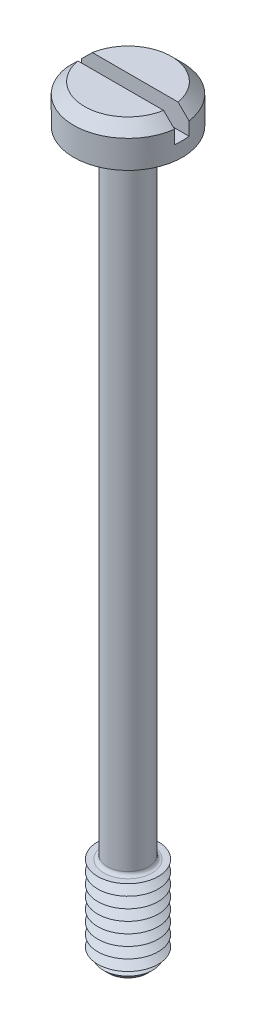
ISO-10303-21;
HEADER;
FILE_DESCRIPTION(('STEP AP214'),'2;1');
FILE_NAME('part.step','',(''),(''),'','','');
FILE_SCHEMA(('AUTOMOTIVE_DESIGN { 1 0 10303 214 1 1 1 1 }'));
ENDSEC;
DATA;
#1=APPLICATION_CONTEXT('core data for automotive mechanical design processes');
#2=APPLICATION_PROTOCOL_DEFINITION('international standard','automotive_design',2000,#1);
#3=PRODUCT_CONTEXT('',#1,'mechanical');
#4=PRODUCT('Part','Part','',(#3));
#5=PRODUCT_RELATED_PRODUCT_CATEGORY('part','',(#4));
#6=PRODUCT_DEFINITION_FORMATION('','',#4);
#7=PRODUCT_DEFINITION_CONTEXT('part definition',#1,'design');
#8=PRODUCT_DEFINITION('design','',#6,#7);
#9=PRODUCT_DEFINITION_SHAPE('','',#8);
#10=(LENGTH_UNIT() NAMED_UNIT(*) SI_UNIT(.MILLI.,.METRE.));
#11=(NAMED_UNIT(*) PLANE_ANGLE_UNIT() SI_UNIT($,.RADIAN.));
#12=(NAMED_UNIT(*) SI_UNIT($,.STERADIAN.) SOLID_ANGLE_UNIT());
#13=UNCERTAINTY_MEASURE_WITH_UNIT(LENGTH_MEASURE(1.E-05),#10,'distance_accuracy_value','');
#14=(GEOMETRIC_REPRESENTATION_CONTEXT(3) GLOBAL_UNCERTAINTY_ASSIGNED_CONTEXT((#13)) GLOBAL_UNIT_ASSIGNED_CONTEXT((#10,
#11,#12)) REPRESENTATION_CONTEXT('',''));
#15=CARTESIAN_POINT('',(0.,0.,0.));
#16=DIRECTION('',(0.,0.,1.));
#17=DIRECTION('',(1.,0.,0.));
#18=AXIS2_PLACEMENT_3D('',#15,#16,#17);
#19=CARTESIAN_POINT('',(0.,1.6,0.));
#20=DIRECTION('',(0.,1.,0.));
#21=DIRECTION('',(0.,0.,1.));
#22=AXIS2_PLACEMENT_3D('',#19,#20,#21);
#23=PLANE('',#22);
#24=DIRECTION('',(-1.,0.,0.));
#25=VECTOR('',#24,1.);
#26=CARTESIAN_POINT('',(2.25,1.6,-0.3));
#27=LINE('',#26,#25);
#28=CARTESIAN_POINT('',(1.77482393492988,1.6,-0.3));
#29=VERTEX_POINT('',#28);
#30=CARTESIAN_POINT('',(-1.77482393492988,1.6,-0.3));
#31=VERTEX_POINT('',#30);
#32=EDGE_CURVE('E110',#29,#31,#27,.T.);
#33=ORIENTED_EDGE('',*,*,#32,.F.);
#34=CARTESIAN_POINT('',(0.,1.6,0.));
#35=DIRECTION('',(0.,1.,0.));
#36=DIRECTION('',(0.,0.,1.));
#37=AXIS2_PLACEMENT_3D('',#34,#35,#36);
#38=CIRCLE('',#37,1.8);
#39=EDGE_CURVE('E113',#29,#31,#38,.T.);
#40=ORIENTED_EDGE('',*,*,#39,.T.);
#41=EDGE_LOOP('',(#33,#40));
#42=FACE_BOUND('',#41,.T.);
#43=ADVANCED_FACE('F39',(#42),#23,.T.);
#44=CARTESIAN_POINT('',(0.,1.6,0.));
#45=DIRECTION('',(0.,-1.,0.));
#46=DIRECTION('',(0.,0.,-1.));
#47=AXIS2_PLACEMENT_3D('',#44,#45,#46);
#48=CONICAL_SURFACE('',#47,1.8,0.785398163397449);
#49=CARTESIAN_POINT('',(4.95459224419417,-1.56366641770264,-0.3));
#50=CARTESIAN_POINT('',(4.78550585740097,-1.39489159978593,-0.3));
#51=CARTESIAN_POINT('',(4.61640599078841,-1.22613027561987,-0.3));
#52=CARTESIAN_POINT('',(4.27815962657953,-0.888649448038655,-0.3));
#53=CARTESIAN_POINT('',(4.10901312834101,-0.71992994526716,-0.3));
#54=CARTESIAN_POINT('',(3.7706037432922,-0.382497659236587,-0.3));
#55=CARTESIAN_POINT('',(3.60134083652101,-0.213784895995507,-0.3));
#56=CARTESIAN_POINT('',(3.26272497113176,0.123545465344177,-0.3));
#57=CARTESIAN_POINT('',(3.0933720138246,0.292163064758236,-0.3));
#58=CARTESIAN_POINT('',(2.74975444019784,0.633985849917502,-0.3));
#59=CARTESIAN_POINT('',(2.57548557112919,0.807186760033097,-0.3));
#60=CARTESIAN_POINT('',(2.22666801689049,1.15332162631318,-0.3));
#61=CARTESIAN_POINT('',(2.05211932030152,1.32625557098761,-0.3));
#62=CARTESIAN_POINT('',(1.78988225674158,1.58520097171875,-0.3));
#63=CARTESIAN_POINT('',(1.70241000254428,1.67143125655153,-0.3));
#64=CARTESIAN_POINT('',(1.52723599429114,1.84366185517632,-0.3));
#65=CARTESIAN_POINT('',(1.43953423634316,1.92966216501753,-0.3));
#66=CARTESIAN_POINT('',(1.26375483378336,2.10126365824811,-0.3));
#67=CARTESIAN_POINT('',(1.17567721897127,2.18686487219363,-0.3));
#68=CARTESIAN_POINT('',(0.998839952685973,2.35735922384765,-0.3));
#69=CARTESIAN_POINT('',(0.910080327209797,2.44225238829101,-0.3));
#70=CARTESIAN_POINT('',(0.796416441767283,2.54899153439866,-0.3));
#71=CARTESIAN_POINT('',(0.772225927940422,2.5715963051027,-0.3));
#72=CARTESIAN_POINT('',(0.72369279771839,2.61664290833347,-0.3));
#73=CARTESIAN_POINT('',(0.699350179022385,2.63908473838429,-0.3));
#74=CARTESIAN_POINT('',(0.650528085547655,2.68369783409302,-0.3));
#75=CARTESIAN_POINT('',(0.626049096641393,2.70586963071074,-0.3));
#76=CARTESIAN_POINT('',(0.576826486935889,2.74991696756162,-0.3));
#77=CARTESIAN_POINT('',(0.552082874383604,2.77179251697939,-0.3));
#78=CARTESIAN_POINT('',(0.495367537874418,2.82108684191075,-0.3));
#79=CARTESIAN_POINT('',(0.463281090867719,2.84837386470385,-0.3));
#80=CARTESIAN_POINT('',(0.398023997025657,2.90193742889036,-0.3));
#81=CARTESIAN_POINT('',(0.364849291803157,2.92820913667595,-0.3));
#82=CARTESIAN_POINT('',(0.313679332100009,2.96610502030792,-0.3));
#83=CARTESIAN_POINT('',(0.29629338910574,2.97854603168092,-0.3));
#84=CARTESIAN_POINT('',(0.260958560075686,3.00259516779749,-0.3));
#85=CARTESIAN_POINT('',(0.243009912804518,3.01420363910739,-0.3));
#86=CARTESIAN_POINT('',(0.206442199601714,3.03612496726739,-0.3));
#87=CARTESIAN_POINT('',(0.18782680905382,3.04644383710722,-0.3));
#88=CARTESIAN_POINT('',(0.149667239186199,3.06515059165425,-0.3));
#89=CARTESIAN_POINT('',(0.13012506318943,3.07354243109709,-0.3));
#90=CARTESIAN_POINT('',(0.0899770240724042,3.0873606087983,-0.3));
#91=CARTESIAN_POINT('',(0.0693720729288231,3.09278944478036,-0.3));
#92=CARTESIAN_POINT('',(0.0275643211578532,3.09943051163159,-0.3));
#93=CARTESIAN_POINT('',(0.00636584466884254,3.1006678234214,-0.3));
#94=CARTESIAN_POINT('',(-0.0358007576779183,3.09861060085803,-0.3));
#95=CARTESIAN_POINT('',(-0.0567687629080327,3.09531379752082,-0.3));
#96=CARTESIAN_POINT('',(-0.0978737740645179,3.08507807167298,-0.3));
#97=CARTESIAN_POINT('',(-0.118004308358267,3.07811501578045,-0.3));
#98=CARTESIAN_POINT('',(-0.162483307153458,3.05957916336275,-0.3));
#99=CARTESIAN_POINT('',(-0.186511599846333,3.04727044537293,-0.3));
#100=CARTESIAN_POINT('',(-0.233318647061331,3.02043354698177,-0.3));
#101=CARTESIAN_POINT('',(-0.256093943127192,3.00589960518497,-0.3));
#102=CARTESIAN_POINT('',(-0.300901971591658,2.97541580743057,-0.3));
#103=CARTESIAN_POINT('',(-0.322928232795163,2.95945657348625,-0.3));
#104=CARTESIAN_POINT('',(-0.366316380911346,2.92672827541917,-0.3));
#105=CARTESIAN_POINT('',(-0.387679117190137,2.90996032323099,-0.3));
#106=CARTESIAN_POINT('',(-0.433394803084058,2.8731039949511,-0.3));
#107=CARTESIAN_POINT('',(-0.457669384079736,2.85291891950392,-0.3));
#108=CARTESIAN_POINT('',(-0.505802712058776,2.812057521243,-0.3));
#109=CARTESIAN_POINT('',(-0.529661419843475,2.79138115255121,-0.3));
#110=CARTESIAN_POINT('',(-0.600811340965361,2.72884009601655,-0.3));
#111=CARTESIAN_POINT('',(-0.647661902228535,2.6864754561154,-0.3));
#112=CARTESIAN_POINT('',(-0.740776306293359,2.60099002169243,-0.3));
#113=CARTESIAN_POINT('',(-0.787039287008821,2.55786829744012,-0.3));
#114=CARTESIAN_POINT('',(-0.879151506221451,2.47120207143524,-0.3));
#115=CARTESIAN_POINT('',(-0.925000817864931,2.42765764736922,-0.3));
#116=CARTESIAN_POINT('',(-1.06157343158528,2.29718252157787,-0.3));
#117=CARTESIAN_POINT('',(-1.15191647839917,2.20985470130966,-0.3));
#118=CARTESIAN_POINT('',(-1.33204374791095,2.0347474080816,-0.3));
#119=CARTESIAN_POINT('',(-1.42182830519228,1.94696827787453,-0.3));
#120=CARTESIAN_POINT('',(-1.65511823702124,1.71815111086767,-0.3));
#121=CARTESIAN_POINT('',(-1.79840096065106,1.57688614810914,-0.3));
#122=CARTESIAN_POINT('',(-2.08462326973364,1.2940074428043,-0.3));
#123=CARTESIAN_POINT('',(-2.22756285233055,1.15239369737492,-0.3));
#124=CARTESIAN_POINT('',(-2.65618391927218,0.727177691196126,-0.3));
#125=CARTESIAN_POINT('',(-2.94157972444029,0.443287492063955,-0.3));
#126=CARTESIAN_POINT('',(-3.51504981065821,-0.12773549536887,-0.3));
#127=CARTESIAN_POINT('',(-3.80312108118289,-0.414871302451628,-0.3));
#128=CARTESIAN_POINT('',(-4.3789998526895,-0.989219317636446,-0.3));
#129=CARTESIAN_POINT('',(-4.66680740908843,-1.27643147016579,-0.3));
#130=CARTESIAN_POINT('',(-4.95459224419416,-1.56366641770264,-0.3));
#131=B_SPLINE_CURVE_WITH_KNOTS('',3,(#49,#50,#51,#52,#53,#54,#55,#56,#57,#58,#59,#60,#61,#62,
#63,#64,#65,#66,#67,#68,#69,#70,#71,#72,#73,#74,#75,#76,#77,#78,#79,#80,#81,#82,#83,#84,#85,#86,
#87,#88,#89,#90,#91,#92,#93,#94,#95,#96,#97,#98,#99,#100,#101,#102,#103,#104,#105,#106,#107,
#108,#109,#110,#111,#112,#113,#114,#115,#116,#117,#118,#119,#120,#121,#122,#123,#124,#125,#126,
#127,#128,#129,#130),.UNSPECIFIED.,.F.,.F.,(4,2,2,2,2,2,2,2,2,2,2,2,2,2,2,2,2,2,2,2,2,2,2,2,2,2,
2,2,2,2,2,2,2,2,2,2,2,2,2,2,4),(0.,0.716712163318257,1.4334347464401,2.1503903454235,
2.86733577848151,3.60443392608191,4.34156295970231,4.71005096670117,5.07854526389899,
5.44701086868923,5.81546249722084,5.91478669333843,6.01411239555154,6.1131930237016,
6.21227057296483,6.33862193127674,6.46551497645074,6.52963544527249,6.59372906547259,
6.65751170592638,6.7211622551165,6.78475906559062,6.8479746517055,6.91122188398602,
6.97489074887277,7.05566851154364,7.13665907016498,7.21822852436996,7.29968885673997,
7.39438996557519,7.48909995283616,7.67857624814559,7.86830424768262,8.05799801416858,
8.43494407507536,8.81163695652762,9.41526715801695,10.0189023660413,11.2265436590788,
12.4467437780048,13.6665454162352),.UNSPECIFIED.);
#132=CARTESIAN_POINT('',(2.2299103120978,1.14999999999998,-0.3));
#133=VERTEX_POINT('',#132);
#134=EDGE_CURVE('E260',#133,#29,#131,.T.);
#135=ORIENTED_EDGE('',*,*,#134,.F.);
#136=CARTESIAN_POINT('',(0.,1.15,0.));
#137=DIRECTION('',(0.,1.,0.));
#138=DIRECTION('',(0.,0.,1.));
#139=AXIS2_PLACEMENT_3D('',#136,#137,#138);
#140=CIRCLE('',#139,2.25);
#141=CARTESIAN_POINT('',(-2.22991031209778,1.15,-0.3));
#142=VERTEX_POINT('',#141);
#143=EDGE_CURVE('E128',#142,#133,#140,.F.);
#144=ORIENTED_EDGE('',*,*,#143,.F.);
#145=EDGE_CURVE('E102',#31,#142,#131,.T.);
#146=ORIENTED_EDGE('',*,*,#145,.F.);
#147=ORIENTED_EDGE('',*,*,#39,.F.);
#148=EDGE_LOOP('',(#135,#144,#146,#147));
#149=FACE_BOUND('',#148,.T.);
#150=ADVANCED_FACE('F222',(#149),#48,.T.);
#151=CARTESIAN_POINT('',(0.,-30.,0.));
#152=DIRECTION('',(0.,1.,0.));
#153=DIRECTION('',(0.,0.,1.));
#154=AXIS2_PLACEMENT_3D('',#151,#152,#153);
#155=CYLINDRICAL_SURFACE('',#154,0.85);
#156=CARTESIAN_POINT('',(0.,-26.15,0.));
#157=DIRECTION('',(0.,-1.,0.));
#158=DIRECTION('',(0.,0.,-1.));
#159=AXIS2_PLACEMENT_3D('',#156,#157,#158);
#160=CIRCLE('',#159,0.85);
#161=CARTESIAN_POINT('',(0.,-26.15,-0.85));
#162=VERTEX_POINT('',#161);
#163=EDGE_CURVE('E123',#162,#162,#160,.F.);
#164=ORIENTED_EDGE('',*,*,#163,.T.);
#165=EDGE_LOOP('',(#164));
#166=FACE_BOUND('',#165,.T.);
#167=CARTESIAN_POINT('',(0.,-0.150000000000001,0.));
#168=DIRECTION('',(0.,1.,0.));
#169=DIRECTION('',(0.,0.,1.));
#170=AXIS2_PLACEMENT_3D('',#167,#168,#169);
#171=CIRCLE('',#170,0.85);
#172=CARTESIAN_POINT('',(0.,-0.150000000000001,0.85));
#173=VERTEX_POINT('',#172);
#174=EDGE_CURVE('E365',#173,#173,#171,.F.);
#175=ORIENTED_EDGE('',*,*,#174,.T.);
#176=EDGE_LOOP('',(#175));
#177=FACE_BOUND('',#176,.T.);
#178=ADVANCED_FACE('F218',(#166,#177),#155,.T.);
#179=CARTESIAN_POINT('',(0.,1.6,0.));
#180=DIRECTION('',(0.,-1.,0.));
#181=DIRECTION('',(0.,0.,-1.));
#182=AXIS2_PLACEMENT_3D('',#179,#180,#181);
#183=CYLINDRICAL_SURFACE('',#182,2.25);
#184=ORIENTED_EDGE('',*,*,#143,.T.);
#185=DIRECTION('',(0.,-1.,0.));
#186=VECTOR('',#185,1.);
#187=CARTESIAN_POINT('',(2.22991031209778,1.6,-0.3));
#188=LINE('',#187,#186);
#189=CARTESIAN_POINT('',(2.22991031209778,0.6,-0.3));
#190=VERTEX_POINT('',#189);
#191=EDGE_CURVE('E64',#133,#190,#188,.T.);
#192=ORIENTED_EDGE('',*,*,#191,.T.);
#193=CARTESIAN_POINT('',(0.,0.6,0.));
#194=DIRECTION('',(0.,1.,0.));
#195=DIRECTION('',(0.,0.,1.));
#196=AXIS2_PLACEMENT_3D('',#193,#194,#195);
#197=CIRCLE('',#196,2.25);
#198=CARTESIAN_POINT('',(2.22991031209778,0.6,0.3));
#199=VERTEX_POINT('',#198);
#200=EDGE_CURVE('E11',#199,#190,#197,.T.);
#201=ORIENTED_EDGE('',*,*,#200,.F.);
#202=DIRECTION('',(0.,-1.,0.));
#203=VECTOR('',#202,1.);
#204=CARTESIAN_POINT('',(2.22991031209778,1.6,0.3));
#205=LINE('',#204,#203);
#206=CARTESIAN_POINT('',(2.22991031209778,1.15,0.3));
#207=VERTEX_POINT('',#206);
#208=EDGE_CURVE('E275',#199,#207,#205,.F.);
#209=ORIENTED_EDGE('',*,*,#208,.T.);
#210=CARTESIAN_POINT('',(-2.2299103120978,1.14999999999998,0.3));
#211=VERTEX_POINT('',#210);
#212=EDGE_CURVE('E120',#207,#211,#140,.F.);
#213=ORIENTED_EDGE('',*,*,#212,.T.);
#214=DIRECTION('',(0.,-1.,0.));
#215=VECTOR('',#214,1.);
#216=CARTESIAN_POINT('',(-2.22991031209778,1.6,0.3));
#217=LINE('',#216,#215);
#218=CARTESIAN_POINT('',(-2.22991031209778,0.6,0.3));
#219=VERTEX_POINT('',#218);
#220=EDGE_CURVE('E96',#211,#219,#217,.T.);
#221=ORIENTED_EDGE('',*,*,#220,.T.);
#222=CARTESIAN_POINT('',(-2.22991031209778,0.6,-0.3));
#223=VERTEX_POINT('',#222);
#224=EDGE_CURVE('E44',#223,#219,#197,.T.);
#225=ORIENTED_EDGE('',*,*,#224,.F.);
#226=DIRECTION('',(0.,-1.,0.));
#227=VECTOR('',#226,1.);
#228=CARTESIAN_POINT('',(-2.22991031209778,1.6,-0.3));
#229=LINE('',#228,#227);
#230=EDGE_CURVE('E280',#223,#142,#229,.F.);
#231=ORIENTED_EDGE('',*,*,#230,.T.);
#232=EDGE_LOOP('',(#184,#192,#201,#209,#213,#221,#225,#231));
#233=FACE_BOUND('',#232,.T.);
#234=CARTESIAN_POINT('',(0.,0.,0.));
#235=DIRECTION('',(0.,1.,0.));
#236=DIRECTION('',(0.,0.,1.));
#237=AXIS2_PLACEMENT_3D('',#234,#235,#236);
#238=CIRCLE('',#237,2.25);
#239=CARTESIAN_POINT('',(0.,0.,2.25));
#240=VERTEX_POINT('',#239);
#241=EDGE_CURVE('E351',#240,#240,#238,.T.);
#242=ORIENTED_EDGE('',*,*,#241,.T.);
#243=EDGE_LOOP('',(#242));
#244=FACE_BOUND('',#243,.T.);
#245=ADVANCED_FACE('F221',(#233,#244),#183,.T.);
#246=DIRECTION('',(1.,0.,0.));
#247=VECTOR('',#246,1.);
#248=CARTESIAN_POINT('',(2.25,1.6,0.3));
#249=LINE('',#248,#247);
#250=CARTESIAN_POINT('',(-1.77482393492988,1.6,0.3));
#251=VERTEX_POINT('',#250);
#252=CARTESIAN_POINT('',(1.77482393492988,1.6,0.3));
#253=VERTEX_POINT('',#252);
#254=EDGE_CURVE('E56',#251,#253,#249,.T.);
#255=ORIENTED_EDGE('',*,*,#254,.F.);
#256=EDGE_CURVE('E108',#251,#253,#38,.T.);
#257=ORIENTED_EDGE('',*,*,#256,.T.);
#258=EDGE_LOOP('',(#255,#257));
#259=FACE_BOUND('',#258,.T.);
#260=ADVANCED_FACE('F107',(#259),#23,.T.);
#261=CARTESIAN_POINT('',(0.,0.,0.));
#262=DIRECTION('',(0.,1.,0.));
#263=DIRECTION('',(0.,0.,1.));
#264=AXIS2_PLACEMENT_3D('',#261,#262,#263);
#265=PLANE('',#264);
#266=CARTESIAN_POINT('',(0.,0.,0.));
#267=DIRECTION('',(0.,1.,0.));
#268=DIRECTION('',(0.,0.,1.));
#269=AXIS2_PLACEMENT_3D('',#266,#267,#268);
#270=CIRCLE('',#269,1.);
#271=CARTESIAN_POINT('',(0.,0.,1.));
#272=VERTEX_POINT('',#271);
#273=EDGE_CURVE('E114',#272,#272,#270,.T.);
#274=ORIENTED_EDGE('',*,*,#273,.T.);
#275=EDGE_LOOP('',(#274));
#276=FACE_BOUND('',#275,.T.);
#277=ORIENTED_EDGE('',*,*,#241,.F.);
#278=EDGE_LOOP('',(#277));
#279=FACE_BOUND('',#278,.T.);
#280=ADVANCED_FACE('F212',(#276,#279),#265,.F.);
#281=CARTESIAN_POINT('',(0.,-26.3,0.));
#282=DIRECTION('',(0.,-1.,0.));
#283=DIRECTION('',(0.,0.,-1.));
#284=AXIS2_PLACEMENT_3D('',#281,#282,#283);
#285=PLANE('',#284);
#286=CARTESIAN_POINT('',(0.,-26.3,0.));
#287=DIRECTION('',(0.,-1.,0.));
#288=DIRECTION('',(0.,0.,-1.));
#289=AXIS2_PLACEMENT_3D('',#286,#287,#288);
#290=CIRCLE('',#289,1.);
#291=CARTESIAN_POINT('',(0.,-26.3,-1.));
#292=VERTEX_POINT('',#291);
#293=EDGE_CURVE('E358',#292,#292,#290,.T.);
#294=ORIENTED_EDGE('',*,*,#293,.T.);
#295=EDGE_LOOP('',(#294));
#296=FACE_BOUND('',#295,.T.);
#297=CARTESIAN_POINT('',(0.,-26.3,0.));
#298=DIRECTION('',(0.,1.,0.));
#299=DIRECTION('',(0.,0.,1.));
#300=AXIS2_PLACEMENT_3D('',#297,#298,#299);
#301=CIRCLE('',#300,1.25);
#302=CARTESIAN_POINT('',(0.,-26.3,1.25));
#303=VERTEX_POINT('',#302);
#304=EDGE_CURVE('E348',#303,#303,#301,.T.);
#305=ORIENTED_EDGE('',*,*,#304,.T.);
#306=EDGE_LOOP('',(#305));
#307=FACE_BOUND('',#306,.T.);
#308=ADVANCED_FACE('F208',(#296,#307),#285,.F.);
#309=CARTESIAN_POINT('',(0.,-26.525,0.));
#310=DIRECTION('',(0.,1.,0.));
#311=DIRECTION('',(0.,0.,1.));
#312=AXIS2_PLACEMENT_3D('',#309,#310,#311);
#313=CONICAL_SURFACE('',#312,0.860288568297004,1.0471975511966);
#314=ORIENTED_EDGE('',*,*,#304,.F.);
#315=EDGE_LOOP('',(#314));
#316=FACE_BOUND('',#315,.T.);
#317=CARTESIAN_POINT('',(0.,-26.525,0.));
#318=DIRECTION('',(0.,1.,0.));
#319=DIRECTION('',(0.,0.,1.));
#320=AXIS2_PLACEMENT_3D('',#317,#318,#319);
#321=CIRCLE('',#320,0.860288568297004);
#322=CARTESIAN_POINT('',(0.,-26.525,0.860288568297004));
#323=VERTEX_POINT('',#322);
#324=EDGE_CURVE('E344',#323,#323,#321,.T.);
#325=ORIENTED_EDGE('',*,*,#324,.T.);
#326=EDGE_LOOP('',(#325));
#327=FACE_BOUND('',#326,.T.);
#328=ADVANCED_FACE('F204',(#316,#327),#313,.T.);
#329=CARTESIAN_POINT('',(0.,-26.75,0.));
#330=DIRECTION('',(0.,-1.,0.));
#331=DIRECTION('',(0.,0.,-1.));
#332=AXIS2_PLACEMENT_3D('',#329,#330,#331);
#333=CONICAL_SURFACE('',#332,1.25,1.0471975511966);
#334=ORIENTED_EDGE('',*,*,#324,.F.);
#335=EDGE_LOOP('',(#334));
#336=FACE_BOUND('',#335,.T.);
#337=CARTESIAN_POINT('',(0.,-26.75,0.));
#338=DIRECTION('',(0.,1.,0.));
#339=DIRECTION('',(0.,0.,1.));
#340=AXIS2_PLACEMENT_3D('',#337,#338,#339);
#341=CIRCLE('',#340,1.25);
#342=CARTESIAN_POINT('',(0.,-26.75,1.25));
#343=VERTEX_POINT('',#342);
#344=EDGE_CURVE('E340',#343,#343,#341,.T.);
#345=ORIENTED_EDGE('',*,*,#344,.T.);
#346=EDGE_LOOP('',(#345));
#347=FACE_BOUND('',#346,.T.);
#348=ADVANCED_FACE('F200',(#336,#347),#333,.T.);
#349=CARTESIAN_POINT('',(0.,-26.975,0.));
#350=DIRECTION('',(0.,1.,0.));
#351=DIRECTION('',(0.,0.,1.));
#352=AXIS2_PLACEMENT_3D('',#349,#350,#351);
#353=CONICAL_SURFACE('',#352,0.860288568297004,1.0471975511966);
#354=ORIENTED_EDGE('',*,*,#344,.F.);
#355=EDGE_LOOP('',(#354));
#356=FACE_BOUND('',#355,.T.);
#357=CARTESIAN_POINT('',(0.,-26.975,0.));
#358=DIRECTION('',(0.,1.,0.));
#359=DIRECTION('',(0.,0.,1.));
#360=AXIS2_PLACEMENT_3D('',#357,#358,#359);
#361=CIRCLE('',#360,0.860288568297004);
#362=CARTESIAN_POINT('',(0.,-26.975,0.860288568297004));
#363=VERTEX_POINT('',#362);
#364=EDGE_CURVE('E336',#363,#363,#361,.T.);
#365=ORIENTED_EDGE('',*,*,#364,.T.);
#366=EDGE_LOOP('',(#365));
#367=FACE_BOUND('',#366,.T.);
#368=ADVANCED_FACE('F196',(#356,#367),#353,.T.);
#369=CARTESIAN_POINT('',(0.,-27.2,0.));
#370=DIRECTION('',(0.,-1.,0.));
#371=DIRECTION('',(0.,0.,-1.));
#372=AXIS2_PLACEMENT_3D('',#369,#370,#371);
#373=CONICAL_SURFACE('',#372,1.25,1.0471975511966);
#374=ORIENTED_EDGE('',*,*,#364,.F.);
#375=EDGE_LOOP('',(#374));
#376=FACE_BOUND('',#375,.T.);
#377=CARTESIAN_POINT('',(0.,-27.2,0.));
#378=DIRECTION('',(0.,1.,0.));
#379=DIRECTION('',(0.,0.,1.));
#380=AXIS2_PLACEMENT_3D('',#377,#378,#379);
#381=CIRCLE('',#380,1.25);
#382=CARTESIAN_POINT('',(0.,-27.2,1.25));
#383=VERTEX_POINT('',#382);
#384=EDGE_CURVE('E332',#383,#383,#381,.T.);
#385=ORIENTED_EDGE('',*,*,#384,.T.);
#386=EDGE_LOOP('',(#385));
#387=FACE_BOUND('',#386,.T.);
#388=ADVANCED_FACE('F192',(#376,#387),#373,.T.);
#389=CARTESIAN_POINT('',(0.,-27.425,0.));
#390=DIRECTION('',(0.,1.,0.));
#391=DIRECTION('',(0.,0.,1.));
#392=AXIS2_PLACEMENT_3D('',#389,#390,#391);
#393=CONICAL_SURFACE('',#392,0.860288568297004,1.0471975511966);
#394=ORIENTED_EDGE('',*,*,#384,.F.);
#395=EDGE_LOOP('',(#394));
#396=FACE_BOUND('',#395,.T.);
#397=CARTESIAN_POINT('',(0.,-27.425,0.));
#398=DIRECTION('',(0.,1.,0.));
#399=DIRECTION('',(0.,0.,1.));
#400=AXIS2_PLACEMENT_3D('',#397,#398,#399);
#401=CIRCLE('',#400,0.860288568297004);
#402=CARTESIAN_POINT('',(0.,-27.425,0.860288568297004));
#403=VERTEX_POINT('',#402);
#404=EDGE_CURVE('E328',#403,#403,#401,.T.);
#405=ORIENTED_EDGE('',*,*,#404,.T.);
#406=EDGE_LOOP('',(#405));
#407=FACE_BOUND('',#406,.T.);
#408=ADVANCED_FACE('F188',(#396,#407),#393,.T.);
#409=CARTESIAN_POINT('',(0.,-27.65,0.));
#410=DIRECTION('',(0.,-1.,0.));
#411=DIRECTION('',(0.,0.,-1.));
#412=AXIS2_PLACEMENT_3D('',#409,#410,#411);
#413=CONICAL_SURFACE('',#412,1.25,1.0471975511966);
#414=ORIENTED_EDGE('',*,*,#404,.F.);
#415=EDGE_LOOP('',(#414));
#416=FACE_BOUND('',#415,.T.);
#417=CARTESIAN_POINT('',(0.,-27.65,0.));
#418=DIRECTION('',(0.,1.,0.));
#419=DIRECTION('',(0.,0.,1.));
#420=AXIS2_PLACEMENT_3D('',#417,#418,#419);
#421=CIRCLE('',#420,1.25);
#422=CARTESIAN_POINT('',(0.,-27.65,1.25));
#423=VERTEX_POINT('',#422);
#424=EDGE_CURVE('E324',#423,#423,#421,.T.);
#425=ORIENTED_EDGE('',*,*,#424,.T.);
#426=EDGE_LOOP('',(#425));
#427=FACE_BOUND('',#426,.T.);
#428=ADVANCED_FACE('F184',(#416,#427),#413,.T.);
#429=CARTESIAN_POINT('',(0.,-27.875,0.));
#430=DIRECTION('',(0.,1.,0.));
#431=DIRECTION('',(0.,0.,1.));
#432=AXIS2_PLACEMENT_3D('',#429,#430,#431);
#433=CONICAL_SURFACE('',#432,0.860288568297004,1.0471975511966);
#434=ORIENTED_EDGE('',*,*,#424,.F.);
#435=EDGE_LOOP('',(#434));
#436=FACE_BOUND('',#435,.T.);
#437=CARTESIAN_POINT('',(0.,-27.875,0.));
#438=DIRECTION('',(0.,1.,0.));
#439=DIRECTION('',(0.,0.,1.));
#440=AXIS2_PLACEMENT_3D('',#437,#438,#439);
#441=CIRCLE('',#440,0.860288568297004);
#442=CARTESIAN_POINT('',(0.,-27.875,0.860288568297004));
#443=VERTEX_POINT('',#442);
#444=EDGE_CURVE('E320',#443,#443,#441,.T.);
#445=ORIENTED_EDGE('',*,*,#444,.T.);
#446=EDGE_LOOP('',(#445));
#447=FACE_BOUND('',#446,.T.);
#448=ADVANCED_FACE('F180',(#436,#447),#433,.T.);
#449=CARTESIAN_POINT('',(0.,-28.1,0.));
#450=DIRECTION('',(0.,-1.,0.));
#451=DIRECTION('',(0.,0.,-1.));
#452=AXIS2_PLACEMENT_3D('',#449,#450,#451);
#453=CONICAL_SURFACE('',#452,1.25,1.0471975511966);
#454=ORIENTED_EDGE('',*,*,#444,.F.);
#455=EDGE_LOOP('',(#454));
#456=FACE_BOUND('',#455,.T.);
#457=CARTESIAN_POINT('',(0.,-28.1,0.));
#458=DIRECTION('',(0.,1.,0.));
#459=DIRECTION('',(0.,0.,1.));
#460=AXIS2_PLACEMENT_3D('',#457,#458,#459);
#461=CIRCLE('',#460,1.25);
#462=CARTESIAN_POINT('',(0.,-28.1,1.25));
#463=VERTEX_POINT('',#462);
#464=EDGE_CURVE('E317',#463,#463,#461,.T.);
#465=ORIENTED_EDGE('',*,*,#464,.T.);
#466=EDGE_LOOP('',(#465));
#467=FACE_BOUND('',#466,.T.);
#468=ADVANCED_FACE('F176',(#456,#467),#453,.T.);
#469=CARTESIAN_POINT('',(0.,-28.325,0.));
#470=DIRECTION('',(0.,1.,0.));
#471=DIRECTION('',(0.,0.,1.));
#472=AXIS2_PLACEMENT_3D('',#469,#470,#471);
#473=CONICAL_SURFACE('',#472,0.860288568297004,1.0471975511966);
#474=ORIENTED_EDGE('',*,*,#464,.F.);
#475=EDGE_LOOP('',(#474));
#476=FACE_BOUND('',#475,.T.);
#477=CARTESIAN_POINT('',(0.,-28.325,0.));
#478=DIRECTION('',(0.,1.,0.));
#479=DIRECTION('',(0.,0.,1.));
#480=AXIS2_PLACEMENT_3D('',#477,#478,#479);
#481=CIRCLE('',#480,0.860288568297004);
#482=CARTESIAN_POINT('',(0.,-28.325,0.860288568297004));
#483=VERTEX_POINT('',#482);
#484=EDGE_CURVE('E313',#483,#483,#481,.T.);
#485=ORIENTED_EDGE('',*,*,#484,.T.);
#486=EDGE_LOOP('',(#485));
#487=FACE_BOUND('',#486,.T.);
#488=ADVANCED_FACE('F172',(#476,#487),#473,.T.);
#489=CARTESIAN_POINT('',(0.,-28.55,0.));
#490=DIRECTION('',(0.,-1.,0.));
#491=DIRECTION('',(0.,0.,-1.));
#492=AXIS2_PLACEMENT_3D('',#489,#490,#491);
#493=CONICAL_SURFACE('',#492,1.25,1.0471975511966);
#494=ORIENTED_EDGE('',*,*,#484,.F.);
#495=EDGE_LOOP('',(#494));
#496=FACE_BOUND('',#495,.T.);
#497=CARTESIAN_POINT('',(0.,-28.55,0.));
#498=DIRECTION('',(0.,1.,0.));
#499=DIRECTION('',(0.,0.,1.));
#500=AXIS2_PLACEMENT_3D('',#497,#498,#499);
#501=CIRCLE('',#500,1.25);
#502=CARTESIAN_POINT('',(0.,-28.55,1.25));
#503=VERTEX_POINT('',#502);
#504=EDGE_CURVE('E309',#503,#503,#501,.T.);
#505=ORIENTED_EDGE('',*,*,#504,.T.);
#506=EDGE_LOOP('',(#505));
#507=FACE_BOUND('',#506,.T.);
#508=ADVANCED_FACE('F168',(#496,#507),#493,.T.);
#509=CARTESIAN_POINT('',(0.,-28.775,0.));
#510=DIRECTION('',(0.,1.,0.));
#511=DIRECTION('',(0.,0.,1.));
#512=AXIS2_PLACEMENT_3D('',#509,#510,#511);
#513=CONICAL_SURFACE('',#512,0.860288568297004,1.0471975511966);
#514=ORIENTED_EDGE('',*,*,#504,.F.);
#515=EDGE_LOOP('',(#514));
#516=FACE_BOUND('',#515,.T.);
#517=CARTESIAN_POINT('',(0.,-28.775,0.));
#518=DIRECTION('',(0.,1.,0.));
#519=DIRECTION('',(0.,0.,1.));
#520=AXIS2_PLACEMENT_3D('',#517,#518,#519);
#521=CIRCLE('',#520,0.860288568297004);
#522=CARTESIAN_POINT('',(0.,-28.775,0.860288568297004));
#523=VERTEX_POINT('',#522);
#524=EDGE_CURVE('E306',#523,#523,#521,.T.);
#525=ORIENTED_EDGE('',*,*,#524,.T.);
#526=EDGE_LOOP('',(#525));
#527=FACE_BOUND('',#526,.T.);
#528=ADVANCED_FACE('F164',(#516,#527),#513,.T.);
#529=CARTESIAN_POINT('',(0.,-29.,0.));
#530=DIRECTION('',(0.,-1.,0.));
#531=DIRECTION('',(0.,0.,-1.));
#532=AXIS2_PLACEMENT_3D('',#529,#530,#531);
#533=CONICAL_SURFACE('',#532,1.25,1.0471975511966);
#534=ORIENTED_EDGE('',*,*,#524,.F.);
#535=EDGE_LOOP('',(#534));
#536=FACE_BOUND('',#535,.T.);
#537=CARTESIAN_POINT('',(0.,-29.,0.));
#538=DIRECTION('',(0.,1.,0.));
#539=DIRECTION('',(0.,0.,1.));
#540=AXIS2_PLACEMENT_3D('',#537,#538,#539);
#541=CIRCLE('',#540,1.25);
#542=CARTESIAN_POINT('',(0.,-29.,1.25));
#543=VERTEX_POINT('',#542);
#544=EDGE_CURVE('E303',#543,#543,#541,.T.);
#545=ORIENTED_EDGE('',*,*,#544,.T.);
#546=EDGE_LOOP('',(#545));
#547=FACE_BOUND('',#546,.T.);
#548=ADVANCED_FACE('F160',(#536,#547),#533,.T.);
#549=CARTESIAN_POINT('',(0.,-29.225,0.));
#550=DIRECTION('',(0.,1.,0.));
#551=DIRECTION('',(0.,0.,1.));
#552=AXIS2_PLACEMENT_3D('',#549,#550,#551);
#553=CONICAL_SURFACE('',#552,0.860288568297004,1.0471975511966);
#554=ORIENTED_EDGE('',*,*,#544,.F.);
#555=EDGE_LOOP('',(#554));
#556=FACE_BOUND('',#555,.T.);
#557=CARTESIAN_POINT('',(0.,-29.225,0.));
#558=DIRECTION('',(0.,1.,0.));
#559=DIRECTION('',(0.,0.,1.));
#560=AXIS2_PLACEMENT_3D('',#557,#558,#559);
#561=CIRCLE('',#560,0.860288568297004);
#562=CARTESIAN_POINT('',(0.,-29.225,0.860288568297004));
#563=VERTEX_POINT('',#562);
#564=EDGE_CURVE('E299',#563,#563,#561,.T.);
#565=ORIENTED_EDGE('',*,*,#564,.T.);
#566=EDGE_LOOP('',(#565));
#567=FACE_BOUND('',#566,.T.);
#568=ADVANCED_FACE('F156',(#556,#567),#553,.T.);
#569=CARTESIAN_POINT('',(0.,-29.45,0.));
#570=DIRECTION('',(0.,-1.,0.));
#571=DIRECTION('',(0.,0.,-1.));
#572=AXIS2_PLACEMENT_3D('',#569,#570,#571);
#573=CONICAL_SURFACE('',#572,1.25,1.0471975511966);
#574=ORIENTED_EDGE('',*,*,#564,.F.);
#575=EDGE_LOOP('',(#574));
#576=FACE_BOUND('',#575,.T.);
#577=CARTESIAN_POINT('',(0.,-29.45,0.));
#578=DIRECTION('',(0.,1.,0.));
#579=DIRECTION('',(0.,0.,1.));
#580=AXIS2_PLACEMENT_3D('',#577,#578,#579);
#581=CIRCLE('',#580,1.25);
#582=CARTESIAN_POINT('',(0.,-29.45,1.25));
#583=VERTEX_POINT('',#582);
#584=EDGE_CURVE('E294',#583,#583,#581,.T.);
#585=ORIENTED_EDGE('',*,*,#584,.T.);
#586=EDGE_LOOP('',(#585));
#587=FACE_BOUND('',#586,.T.);
#588=ADVANCED_FACE('F152',(#576,#587),#573,.T.);
#589=CARTESIAN_POINT('',(0.,-29.675,0.));
#590=DIRECTION('',(0.,1.,0.));
#591=DIRECTION('',(0.,0.,1.));
#592=AXIS2_PLACEMENT_3D('',#589,#590,#591);
#593=CONICAL_SURFACE('',#592,0.860288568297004,1.0471975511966);
#594=ORIENTED_EDGE('',*,*,#584,.F.);
#595=EDGE_LOOP('',(#594));
#596=FACE_BOUND('',#595,.T.);
#597=CARTESIAN_POINT('',(0.,-29.675,0.));
#598=DIRECTION('',(0.,1.,0.));
#599=DIRECTION('',(0.,0.,1.));
#600=AXIS2_PLACEMENT_3D('',#597,#598,#599);
#601=CIRCLE('',#600,0.860288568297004);
#602=CARTESIAN_POINT('',(0.,-29.675,0.860288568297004));
#603=VERTEX_POINT('',#602);
#604=EDGE_CURVE('E290',#603,#603,#601,.T.);
#605=ORIENTED_EDGE('',*,*,#604,.T.);
#606=EDGE_LOOP('',(#605));
#607=FACE_BOUND('',#606,.T.);
#608=ADVANCED_FACE('F148',(#596,#607),#593,.T.);
#609=CARTESIAN_POINT('',(0.,-29.9,0.));
#610=DIRECTION('',(0.,-1.,0.));
#611=DIRECTION('',(0.,0.,-1.));
#612=AXIS2_PLACEMENT_3D('',#609,#610,#611);
#613=CONICAL_SURFACE('',#612,1.25,1.0471975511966);
#614=CARTESIAN_POINT('',(0.,-29.7718911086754,0.));
#615=DIRECTION('',(0.,-1.,0.));
#616=DIRECTION('',(0.,0.,-1.));
#617=AXIS2_PLACEMENT_3D('',#614,#615,#616);
#618=CIRCLE('',#617,1.02810889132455);
#619=CARTESIAN_POINT('',(0.,-29.7718911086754,-1.02810889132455));
#620=VERTEX_POINT('',#619);
#621=EDGE_CURVE('E298',#620,#620,#618,.F.);
#622=ORIENTED_EDGE('',*,*,#621,.T.);
#623=EDGE_LOOP('',(#622));
#624=FACE_BOUND('',#623,.T.);
#625=ORIENTED_EDGE('',*,*,#604,.F.);
#626=EDGE_LOOP('',(#625));
#627=FACE_BOUND('',#626,.T.);
#628=ADVANCED_FACE('F144',(#624,#627),#613,.T.);
#629=CARTESIAN_POINT('',(0.,-30.,0.));
#630=DIRECTION('',(0.,-1.,0.));
#631=DIRECTION('',(0.,0.,-1.));
#632=AXIS2_PLACEMENT_3D('',#629,#630,#631);
#633=PLANE('',#632);
#634=CARTESIAN_POINT('',(0.,-30.,0.));
#635=DIRECTION('',(0.,-1.,0.));
#636=DIRECTION('',(0.,0.,-1.));
#637=AXIS2_PLACEMENT_3D('',#634,#635,#636);
#638=CIRCLE('',#637,0.800000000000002);
#639=CARTESIAN_POINT('',(0.,-30.,-0.800000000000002));
#640=VERTEX_POINT('',#639);
#641=EDGE_CURVE('E354',#640,#640,#638,.T.);
#642=ORIENTED_EDGE('',*,*,#641,.T.);
#643=EDGE_LOOP('',(#642));
#644=FACE_BOUND('',#643,.T.);
#645=ADVANCED_FACE('F147',(#644),#633,.T.);
#646=CARTESIAN_POINT('',(0.,-30.,0.));
#647=DIRECTION('',(0.,1.,0.));
#648=DIRECTION('',(0.,0.,1.));
#649=AXIS2_PLACEMENT_3D('',#646,#647,#648);
#650=CONICAL_SURFACE('',#649,0.800000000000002,0.785398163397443);
#651=ORIENTED_EDGE('',*,*,#621,.F.);
#652=EDGE_LOOP('',(#651));
#653=FACE_BOUND('',#652,.T.);
#654=ORIENTED_EDGE('',*,*,#641,.F.);
#655=EDGE_LOOP('',(#654));
#656=FACE_BOUND('',#655,.T.);
#657=ADVANCED_FACE('F216',(#653,#656),#650,.T.);
#658=CARTESIAN_POINT('',(0.,-26.15,0.));
#659=DIRECTION('',(0.,-1.,0.));
#660=DIRECTION('',(0.,0.,-1.));
#661=AXIS2_PLACEMENT_3D('',#658,#659,#660);
#662=TOROIDAL_SURFACE('',#661,1.,0.15);
#663=ORIENTED_EDGE('',*,*,#163,.F.);
#664=EDGE_LOOP('',(#663));
#665=FACE_BOUND('',#664,.T.);
#666=ORIENTED_EDGE('',*,*,#293,.F.);
#667=EDGE_LOOP('',(#666));
#668=FACE_BOUND('',#667,.T.);
#669=ADVANCED_FACE('F234',(#665,#668),#662,.F.);
#670=CARTESIAN_POINT('',(0.,-0.150000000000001,0.));
#671=DIRECTION('',(0.,1.,0.));
#672=DIRECTION('',(0.,0.,1.));
#673=AXIS2_PLACEMENT_3D('',#670,#671,#672);
#674=TOROIDAL_SURFACE('',#673,1.,0.15);
#675=ORIENTED_EDGE('',*,*,#273,.F.);
#676=EDGE_LOOP('',(#675));
#677=FACE_BOUND('',#676,.T.);
#678=ORIENTED_EDGE('',*,*,#174,.F.);
#679=EDGE_LOOP('',(#678));
#680=FACE_BOUND('',#679,.T.);
#681=ADVANCED_FACE('F237',(#677,#680),#674,.F.);
#682=CARTESIAN_POINT('',(-4.95459224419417,-1.56366641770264,0.3));
#683=CARTESIAN_POINT('',(-4.78550585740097,-1.39489159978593,0.3));
#684=CARTESIAN_POINT('',(-4.61640599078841,-1.22613027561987,0.3));
#685=CARTESIAN_POINT('',(-4.27815962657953,-0.888649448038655,0.3));
#686=CARTESIAN_POINT('',(-4.10901312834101,-0.71992994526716,0.3));
#687=CARTESIAN_POINT('',(-3.7706037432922,-0.382497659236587,0.3));
#688=CARTESIAN_POINT('',(-3.60134083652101,-0.213784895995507,0.3));
#689=CARTESIAN_POINT('',(-3.26272497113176,0.123545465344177,0.3));
#690=CARTESIAN_POINT('',(-3.0933720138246,0.292163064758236,0.3));
#691=CARTESIAN_POINT('',(-2.74975444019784,0.633985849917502,0.3));
#692=CARTESIAN_POINT('',(-2.57548557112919,0.807186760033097,0.3));
#693=CARTESIAN_POINT('',(-2.22666801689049,1.15332162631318,0.3));
#694=CARTESIAN_POINT('',(-2.05211932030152,1.32625557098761,0.3));
#695=CARTESIAN_POINT('',(-1.78988225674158,1.58520097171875,0.3));
#696=CARTESIAN_POINT('',(-1.70241000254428,1.67143125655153,0.3));
#697=CARTESIAN_POINT('',(-1.52723599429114,1.84366185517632,0.3));
#698=CARTESIAN_POINT('',(-1.43953423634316,1.92966216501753,0.3));
#699=CARTESIAN_POINT('',(-1.26375483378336,2.10126365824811,0.3));
#700=CARTESIAN_POINT('',(-1.17567721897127,2.18686487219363,0.3));
#701=CARTESIAN_POINT('',(-0.998839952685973,2.35735922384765,0.3));
#702=CARTESIAN_POINT('',(-0.910080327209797,2.44225238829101,0.3));
#703=CARTESIAN_POINT('',(-0.796416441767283,2.54899153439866,0.3));
#704=CARTESIAN_POINT('',(-0.772225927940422,2.5715963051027,0.3));
#705=CARTESIAN_POINT('',(-0.72369279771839,2.61664290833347,0.3));
#706=CARTESIAN_POINT('',(-0.699350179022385,2.63908473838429,0.3));
#707=CARTESIAN_POINT('',(-0.650528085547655,2.68369783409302,0.3));
#708=CARTESIAN_POINT('',(-0.626049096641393,2.70586963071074,0.3));
#709=CARTESIAN_POINT('',(-0.576826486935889,2.74991696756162,0.3));
#710=CARTESIAN_POINT('',(-0.552082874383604,2.77179251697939,0.3));
#711=CARTESIAN_POINT('',(-0.495367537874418,2.82108684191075,0.3));
#712=CARTESIAN_POINT('',(-0.463281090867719,2.84837386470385,0.3));
#713=CARTESIAN_POINT('',(-0.398023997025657,2.90193742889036,0.3));
#714=CARTESIAN_POINT('',(-0.364849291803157,2.92820913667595,0.3));
#715=CARTESIAN_POINT('',(-0.313679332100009,2.96610502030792,0.3));
#716=CARTESIAN_POINT('',(-0.29629338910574,2.97854603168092,0.3));
#717=CARTESIAN_POINT('',(-0.260958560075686,3.00259516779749,0.3));
#718=CARTESIAN_POINT('',(-0.243009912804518,3.01420363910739,0.3));
#719=CARTESIAN_POINT('',(-0.206442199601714,3.03612496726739,0.3));
#720=CARTESIAN_POINT('',(-0.18782680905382,3.04644383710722,0.3));
#721=CARTESIAN_POINT('',(-0.149667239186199,3.06515059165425,0.3));
#722=CARTESIAN_POINT('',(-0.13012506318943,3.07354243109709,0.3));
#723=CARTESIAN_POINT('',(-0.0899770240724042,3.0873606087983,0.3));
#724=CARTESIAN_POINT('',(-0.0693720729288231,3.09278944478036,0.3));
#725=CARTESIAN_POINT('',(-0.0275643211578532,3.09943051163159,0.3));
#726=CARTESIAN_POINT('',(-0.00636584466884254,3.1006678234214,0.3));
#727=CARTESIAN_POINT('',(0.0358007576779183,3.09861060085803,0.3));
#728=CARTESIAN_POINT('',(0.0567687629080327,3.09531379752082,0.3));
#729=CARTESIAN_POINT('',(0.0978737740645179,3.08507807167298,0.3));
#730=CARTESIAN_POINT('',(0.118004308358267,3.07811501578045,0.3));
#731=CARTESIAN_POINT('',(0.162483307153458,3.05957916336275,0.3));
#732=CARTESIAN_POINT('',(0.186511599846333,3.04727044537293,0.3));
#733=CARTESIAN_POINT('',(0.233318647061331,3.02043354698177,0.3));
#734=CARTESIAN_POINT('',(0.256093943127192,3.00589960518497,0.3));
#735=CARTESIAN_POINT('',(0.300901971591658,2.97541580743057,0.3));
#736=CARTESIAN_POINT('',(0.322928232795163,2.95945657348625,0.3));
#737=CARTESIAN_POINT('',(0.366316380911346,2.92672827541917,0.3));
#738=CARTESIAN_POINT('',(0.387679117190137,2.90996032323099,0.3));
#739=CARTESIAN_POINT('',(0.433394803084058,2.8731039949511,0.3));
#740=CARTESIAN_POINT('',(0.457669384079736,2.85291891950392,0.3));
#741=CARTESIAN_POINT('',(0.505802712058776,2.812057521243,0.3));
#742=CARTESIAN_POINT('',(0.529661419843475,2.79138115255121,0.3));
#743=CARTESIAN_POINT('',(0.600811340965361,2.72884009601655,0.3));
#744=CARTESIAN_POINT('',(0.647661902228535,2.6864754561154,0.3));
#745=CARTESIAN_POINT('',(0.740776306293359,2.60099002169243,0.3));
#746=CARTESIAN_POINT('',(0.787039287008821,2.55786829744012,0.3));
#747=CARTESIAN_POINT('',(0.879151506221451,2.47120207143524,0.3));
#748=CARTESIAN_POINT('',(0.925000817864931,2.42765764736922,0.3));
#749=CARTESIAN_POINT('',(1.06157343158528,2.29718252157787,0.3));
#750=CARTESIAN_POINT('',(1.15191647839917,2.20985470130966,0.3));
#751=CARTESIAN_POINT('',(1.33204374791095,2.0347474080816,0.3));
#752=CARTESIAN_POINT('',(1.42182830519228,1.94696827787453,0.3));
#753=CARTESIAN_POINT('',(1.65511823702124,1.71815111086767,0.3));
#754=CARTESIAN_POINT('',(1.79840096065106,1.57688614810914,0.3));
#755=CARTESIAN_POINT('',(2.08462326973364,1.2940074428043,0.3));
#756=CARTESIAN_POINT('',(2.22756285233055,1.15239369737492,0.3));
#757=CARTESIAN_POINT('',(2.65618391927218,0.727177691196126,0.3));
#758=CARTESIAN_POINT('',(2.94157972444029,0.443287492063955,0.3));
#759=CARTESIAN_POINT('',(3.51504981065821,-0.12773549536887,0.3));
#760=CARTESIAN_POINT('',(3.80312108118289,-0.414871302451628,0.3));
#761=CARTESIAN_POINT('',(4.3789998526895,-0.989219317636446,0.3));
#762=CARTESIAN_POINT('',(4.66680740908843,-1.27643147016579,0.3));
#763=CARTESIAN_POINT('',(4.95459224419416,-1.56366641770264,0.3));
#764=B_SPLINE_CURVE_WITH_KNOTS('',3,(#682,#683,#684,#685,#686,#687,#688,#689,#690,#691,#692,
#693,#694,#695,#696,#697,#698,#699,#700,#701,#702,#703,#704,#705,#706,#707,#708,#709,#710,#711,
#712,#713,#714,#715,#716,#717,#718,#719,#720,#721,#722,#723,#724,#725,#726,#727,#728,#729,#730,
#731,#732,#733,#734,#735,#736,#737,#738,#739,#740,#741,#742,#743,#744,#745,#746,#747,#748,#749,
#750,#751,#752,#753,#754,#755,#756,#757,#758,#759,#760,#761,#762,#763),.UNSPECIFIED.,.F.,.F.,(4,
2,2,2,2,2,2,2,2,2,2,2,2,2,2,2,2,2,2,2,2,2,2,2,2,2,2,2,2,2,2,2,2,2,2,2,2,2,2,2,4),(0.,
0.716712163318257,1.4334347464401,2.1503903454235,2.86733577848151,3.60443392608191,
4.34156295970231,4.71005096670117,5.07854526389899,5.44701086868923,5.81546249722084,
5.91478669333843,6.01411239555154,6.1131930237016,6.21227057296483,6.33862193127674,
6.46551497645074,6.52963544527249,6.59372906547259,6.65751170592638,6.7211622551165,
6.78475906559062,6.8479746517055,6.91122188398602,6.97489074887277,7.05566851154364,
7.13665907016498,7.21822852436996,7.29968885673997,7.39438996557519,7.48909995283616,
7.67857624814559,7.86830424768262,8.05799801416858,8.43494407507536,8.81163695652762,
9.41526715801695,10.0189023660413,11.2265436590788,12.4467437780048,13.6665454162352),.UNSPECIFIED.);
#765=EDGE_CURVE('E92',#211,#251,#764,.T.);
#766=ORIENTED_EDGE('',*,*,#765,.F.);
#767=ORIENTED_EDGE('',*,*,#212,.F.);
#768=EDGE_CURVE('E103',#253,#207,#764,.T.);
#769=ORIENTED_EDGE('',*,*,#768,.F.);
#770=ORIENTED_EDGE('',*,*,#256,.F.);
#771=EDGE_LOOP('',(#766,#767,#769,#770));
#772=FACE_BOUND('',#771,.T.);
#773=ADVANCED_FACE('F41',(#772),#48,.T.);
#774=CARTESIAN_POINT('',(0.,0.6,0.));
#775=DIRECTION('',(0.,1.,0.));
#776=DIRECTION('',(0.,0.,1.));
#777=AXIS2_PLACEMENT_3D('',#774,#775,#776);
#778=PLANE('',#777);
#779=DIRECTION('',(1.,0.,0.));
#780=VECTOR('',#779,1.);
#781=CARTESIAN_POINT('',(2.25,0.6,0.3));
#782=LINE('',#781,#780);
#783=EDGE_CURVE('E257',#219,#199,#782,.T.);
#784=ORIENTED_EDGE('',*,*,#783,.T.);
#785=ORIENTED_EDGE('',*,*,#200,.T.);
#786=DIRECTION('',(-1.,0.,0.));
#787=VECTOR('',#786,1.);
#788=CARTESIAN_POINT('',(2.25,0.6,-0.3));
#789=LINE('',#788,#787);
#790=EDGE_CURVE('E272',#190,#223,#789,.T.);
#791=ORIENTED_EDGE('',*,*,#790,.T.);
#792=ORIENTED_EDGE('',*,*,#224,.T.);
#793=EDGE_LOOP('',(#784,#785,#791,#792));
#794=FACE_BOUND('',#793,.T.);
#795=ADVANCED_FACE('F244',(#794),#778,.T.);
#796=CARTESIAN_POINT('',(2.25,0.6,-0.3));
#797=DIRECTION('',(0.,0.,-1.));
#798=DIRECTION('',(-1.,0.,0.));
#799=AXIS2_PLACEMENT_3D('',#796,#797,#798);
#800=PLANE('',#799);
#801=ORIENTED_EDGE('',*,*,#134,.T.);
#802=ORIENTED_EDGE('',*,*,#32,.T.);
#803=ORIENTED_EDGE('',*,*,#145,.T.);
#804=ORIENTED_EDGE('',*,*,#230,.F.);
#805=ORIENTED_EDGE('',*,*,#790,.F.);
#806=ORIENTED_EDGE('',*,*,#191,.F.);
#807=EDGE_LOOP('',(#801,#802,#803,#804,#805,#806));
#808=FACE_BOUND('',#807,.T.);
#809=ADVANCED_FACE('F141',(#808),#800,.F.);
#810=CARTESIAN_POINT('',(2.25,0.6,0.3));
#811=DIRECTION('',(0.,0.,1.));
#812=DIRECTION('',(1.,0.,0.));
#813=AXIS2_PLACEMENT_3D('',#810,#811,#812);
#814=PLANE('',#813);
#815=ORIENTED_EDGE('',*,*,#765,.T.);
#816=ORIENTED_EDGE('',*,*,#254,.T.);
#817=ORIENTED_EDGE('',*,*,#768,.T.);
#818=ORIENTED_EDGE('',*,*,#208,.F.);
#819=ORIENTED_EDGE('',*,*,#783,.F.);
#820=ORIENTED_EDGE('',*,*,#220,.F.);
#821=EDGE_LOOP('',(#815,#816,#817,#818,#819,#820));
#822=FACE_BOUND('',#821,.T.);
#823=ADVANCED_FACE('F93',(#822),#814,.F.);
#824=CLOSED_SHELL('',(#43,#150,#178,#245,#260,#280,#308,#328,#348,#368,#388,#408,#428,#448,#468,
#488,#508,#528,#548,#568,#588,#608,#628,#645,#657,#669,#681,#773,#795,#809,#823));
#825=MANIFOLD_SOLID_BREP('B2',#824);
#826=ADVANCED_BREP_SHAPE_REPRESENTATION('',(#18,#825),#14);
#827=SHAPE_DEFINITION_REPRESENTATION(#9,#826);
ENDSEC;
END-ISO-10303-21;
